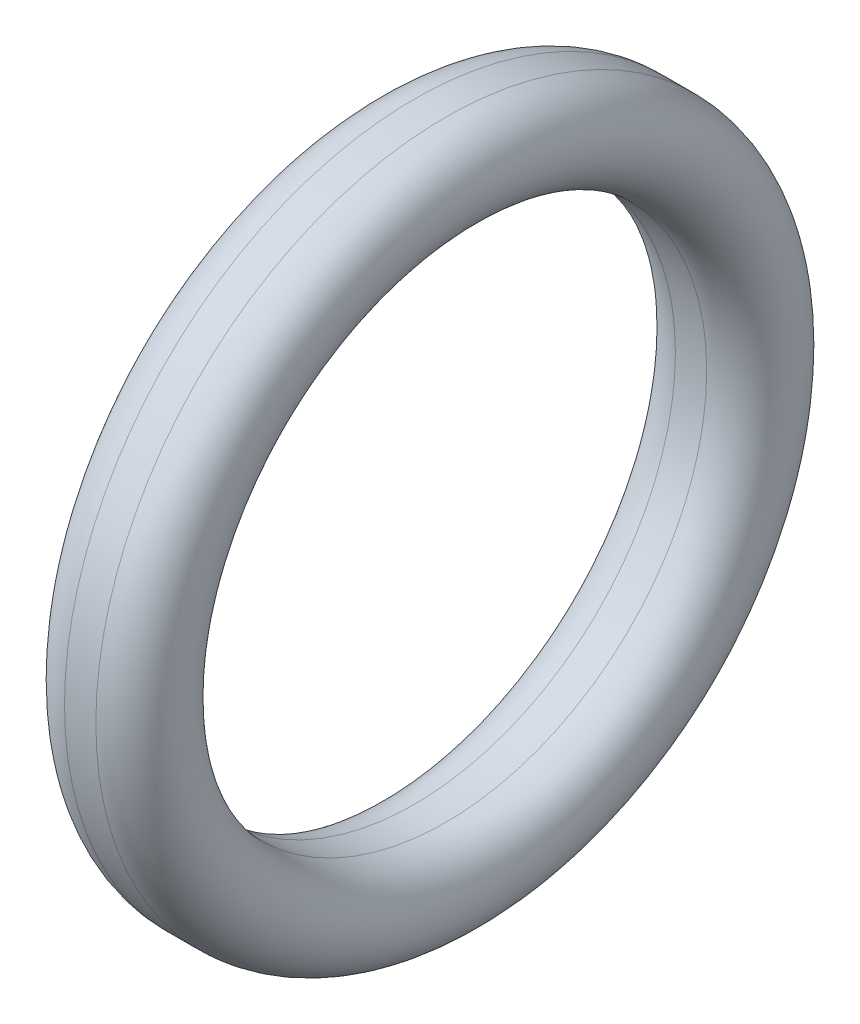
ISO-10303-21;
HEADER;
FILE_DESCRIPTION(('STEP AP214'),'2;1');
FILE_NAME('part.step','',(''),(''),'','','');
FILE_SCHEMA(('AUTOMOTIVE_DESIGN { 1 0 10303 214 1 1 1 1 }'));
ENDSEC;
DATA;
#1=APPLICATION_CONTEXT('core data for automotive mechanical design processes');
#2=APPLICATION_PROTOCOL_DEFINITION('international standard','automotive_design',2000,#1);
#3=PRODUCT_CONTEXT('',#1,'mechanical');
#4=PRODUCT('Part','Part','',(#3));
#5=PRODUCT_RELATED_PRODUCT_CATEGORY('part','',(#4));
#6=PRODUCT_DEFINITION_FORMATION('','',#4);
#7=PRODUCT_DEFINITION_CONTEXT('part definition',#1,'design');
#8=PRODUCT_DEFINITION('design','',#6,#7);
#9=PRODUCT_DEFINITION_SHAPE('','',#8);
#10=(LENGTH_UNIT() NAMED_UNIT(*) SI_UNIT(.MILLI.,.METRE.));
#11=(NAMED_UNIT(*) PLANE_ANGLE_UNIT() SI_UNIT($,.RADIAN.));
#12=(NAMED_UNIT(*) SI_UNIT($,.STERADIAN.) SOLID_ANGLE_UNIT());
#13=UNCERTAINTY_MEASURE_WITH_UNIT(LENGTH_MEASURE(1.E-05),#10,'distance_accuracy_value','');
#14=(GEOMETRIC_REPRESENTATION_CONTEXT(3) GLOBAL_UNCERTAINTY_ASSIGNED_CONTEXT((#13)) GLOBAL_UNIT_ASSIGNED_CONTEXT((#10,
#11,#12)) REPRESENTATION_CONTEXT('',''));
#15=CARTESIAN_POINT('',(0.,0.,0.));
#16=DIRECTION('',(0.,0.,1.));
#17=DIRECTION('',(1.,0.,0.));
#18=AXIS2_PLACEMENT_3D('',#15,#16,#17);
#19=CARTESIAN_POINT('',(-0.180000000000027,0.,0.));
#20=DIRECTION('',(-1.,0.,0.));
#21=DIRECTION('',(0.,0.,1.));
#22=AXIS2_PLACEMENT_3D('',#19,#20,#21);
#23=TOROIDAL_SURFACE('',#22,3.51,0.51);
#24=CARTESIAN_POINT('',(-0.180000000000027,0.,0.));
#25=DIRECTION('',(-1.,0.,0.));
#26=DIRECTION('',(0.,0.,1.));
#27=AXIS2_PLACEMENT_3D('',#24,#25,#26);
#28=CIRCLE('',#27,4.02);
#29=CARTESIAN_POINT('',(-0.180000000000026,0.,4.02));
#30=VERTEX_POINT('',#29);
#31=EDGE_CURVE('E10',#30,#30,#28,.T.);
#32=ORIENTED_EDGE('',*,*,#31,.T.);
#33=EDGE_LOOP('',(#32));
#34=FACE_BOUND('',#33,.T.);
#35=CARTESIAN_POINT('',(-0.180000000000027,0.,0.));
#36=DIRECTION('',(-1.,0.,0.));
#37=DIRECTION('',(0.,0.,1.));
#38=AXIS2_PLACEMENT_3D('',#35,#36,#37);
#39=CIRCLE('',#38,3.);
#40=CARTESIAN_POINT('',(-0.180000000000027,0.,3.));
#41=VERTEX_POINT('',#40);
#42=EDGE_CURVE('E38',#41,#41,#39,.T.);
#43=ORIENTED_EDGE('',*,*,#42,.F.);
#44=EDGE_LOOP('',(#43));
#45=FACE_BOUND('',#44,.T.);
#46=ADVANCED_FACE('F14',(#34,#45),#23,.T.);
#47=CARTESIAN_POINT('',(0.,0.,0.));
#48=DIRECTION('',(-1.,0.,0.));
#49=DIRECTION('',(0.,0.,1.));
#50=AXIS2_PLACEMENT_3D('',#47,#48,#49);
#51=CYLINDRICAL_SURFACE('',#50,4.02);
#52=CARTESIAN_POINT('',(0.180000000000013,0.,0.));
#53=DIRECTION('',(-1.,0.,0.));
#54=DIRECTION('',(0.,0.,1.));
#55=AXIS2_PLACEMENT_3D('',#52,#53,#54);
#56=CIRCLE('',#55,4.02);
#57=CARTESIAN_POINT('',(0.180000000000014,0.,4.01999999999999));
#58=VERTEX_POINT('',#57);
#59=EDGE_CURVE('E21',#58,#58,#56,.T.);
#60=ORIENTED_EDGE('',*,*,#59,.T.);
#61=EDGE_LOOP('',(#60));
#62=FACE_BOUND('',#61,.T.);
#63=ORIENTED_EDGE('',*,*,#31,.F.);
#64=EDGE_LOOP('',(#63));
#65=FACE_BOUND('',#64,.T.);
#66=ADVANCED_FACE('F49',(#62,#65),#51,.T.);
#67=CARTESIAN_POINT('',(0.180000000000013,0.,0.));
#68=DIRECTION('',(-1.,0.,0.));
#69=DIRECTION('',(0.,0.,1.));
#70=AXIS2_PLACEMENT_3D('',#67,#68,#69);
#71=TOROIDAL_SURFACE('',#70,3.51,0.51);
#72=CARTESIAN_POINT('',(0.180000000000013,0.,0.));
#73=DIRECTION('',(-1.,0.,0.));
#74=DIRECTION('',(0.,0.,1.));
#75=AXIS2_PLACEMENT_3D('',#72,#73,#74);
#76=CIRCLE('',#75,3.);
#77=CARTESIAN_POINT('',(0.180000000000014,0.,2.99999999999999));
#78=VERTEX_POINT('',#77);
#79=EDGE_CURVE('E30',#78,#78,#76,.T.);
#80=ORIENTED_EDGE('',*,*,#79,.T.);
#81=EDGE_LOOP('',(#80));
#82=FACE_BOUND('',#81,.T.);
#83=ORIENTED_EDGE('',*,*,#59,.F.);
#84=EDGE_LOOP('',(#83));
#85=FACE_BOUND('',#84,.T.);
#86=ADVANCED_FACE('F53',(#82,#85),#71,.T.);
#87=CARTESIAN_POINT('',(0.,0.,0.));
#88=DIRECTION('',(-1.,0.,0.));
#89=DIRECTION('',(0.,0.,1.));
#90=AXIS2_PLACEMENT_3D('',#87,#88,#89);
#91=CYLINDRICAL_SURFACE('',#90,3.);
#92=ORIENTED_EDGE('',*,*,#42,.T.);
#93=EDGE_LOOP('',(#92));
#94=FACE_BOUND('',#93,.T.);
#95=ORIENTED_EDGE('',*,*,#79,.F.);
#96=EDGE_LOOP('',(#95));
#97=FACE_BOUND('',#96,.T.);
#98=ADVANCED_FACE('F45',(#94,#97),#91,.F.);
#99=CLOSED_SHELL('',(#46,#66,#86,#98));
#100=MANIFOLD_SOLID_BREP('B1',#99);
#101=ADVANCED_BREP_SHAPE_REPRESENTATION('',(#18,#100),#14);
#102=SHAPE_DEFINITION_REPRESENTATION(#9,#101);
ENDSEC;
END-ISO-10303-21;
